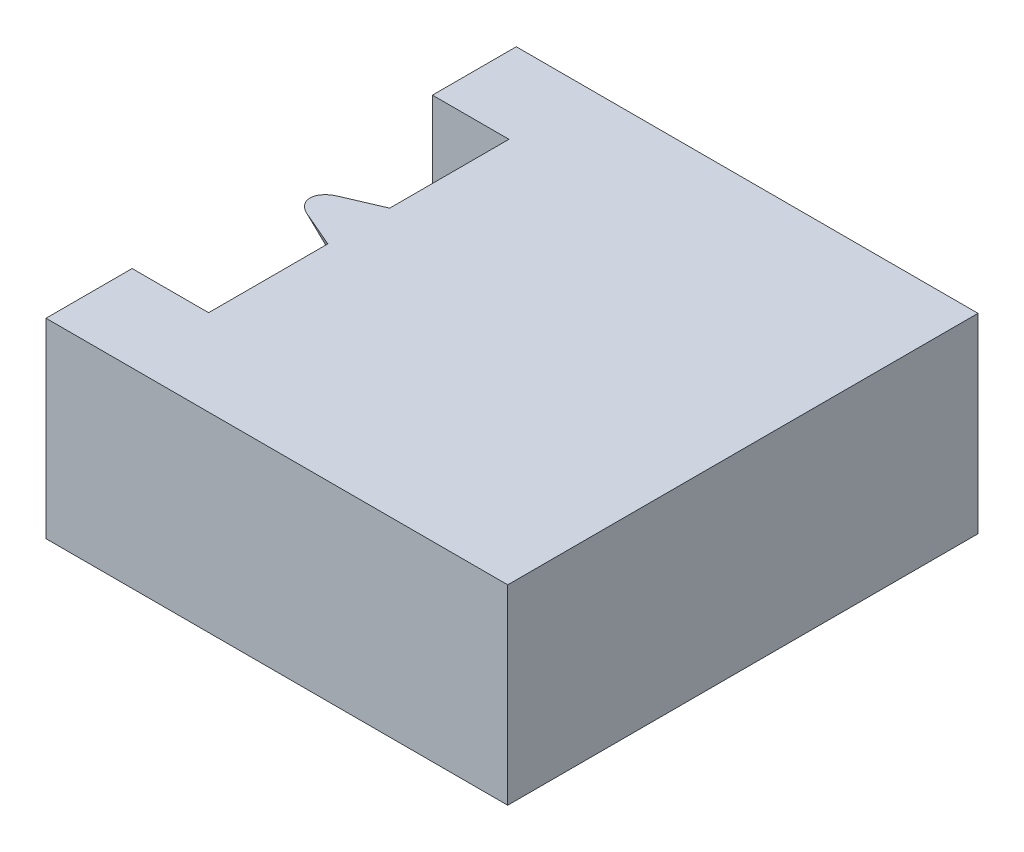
ISO-10303-21;
HEADER;
FILE_DESCRIPTION(('STEP AP214'),'2;1');
FILE_NAME('part.step','',(''),(''),'','','');
FILE_SCHEMA(('AUTOMOTIVE_DESIGN { 1 0 10303 214 1 1 1 1 }'));
ENDSEC;
DATA;
#1=APPLICATION_CONTEXT('core data for automotive mechanical design processes');
#2=APPLICATION_PROTOCOL_DEFINITION('international standard','automotive_design',2000,#1);
#3=PRODUCT_CONTEXT('',#1,'mechanical');
#4=PRODUCT('Part','Part','',(#3));
#5=PRODUCT_RELATED_PRODUCT_CATEGORY('part','',(#4));
#6=PRODUCT_DEFINITION_FORMATION('','',#4);
#7=PRODUCT_DEFINITION_CONTEXT('part definition',#1,'design');
#8=PRODUCT_DEFINITION('design','',#6,#7);
#9=PRODUCT_DEFINITION_SHAPE('','',#8);
#10=(LENGTH_UNIT() NAMED_UNIT(*) SI_UNIT(.MILLI.,.METRE.));
#11=(NAMED_UNIT(*) PLANE_ANGLE_UNIT() SI_UNIT($,.RADIAN.));
#12=(NAMED_UNIT(*) SI_UNIT($,.STERADIAN.) SOLID_ANGLE_UNIT());
#13=UNCERTAINTY_MEASURE_WITH_UNIT(LENGTH_MEASURE(1.E-05),#10,'distance_accuracy_value','');
#14=(GEOMETRIC_REPRESENTATION_CONTEXT(3) GLOBAL_UNCERTAINTY_ASSIGNED_CONTEXT((#13)) GLOBAL_UNIT_ASSIGNED_CONTEXT((#10,
#11,#12)) REPRESENTATION_CONTEXT('',''));
#15=CARTESIAN_POINT('',(0.,0.,0.));
#16=DIRECTION('',(0.,0.,1.));
#17=DIRECTION('',(1.,0.,0.));
#18=AXIS2_PLACEMENT_3D('',#15,#16,#17);
#19=CARTESIAN_POINT('',(-10.6910564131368,-12.5,15.4211919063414));
#20=DIRECTION('',(1.,0.,0.));
#21=DIRECTION('',(0.,0.,-1.));
#22=AXIS2_PLACEMENT_3D('',#19,#20,#21);
#23=PLANE('',#22);
#24=DIRECTION('',(0.,0.911273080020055,0.411802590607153));
#25=VECTOR('',#24,1.);
#26=CARTESIAN_POINT('',(-10.6910564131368,-7.77295609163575,4.96077237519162));
#27=LINE('',#26,#25);
#28=CARTESIAN_POINT('',(-10.6910564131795,-4.1540800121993,6.59613566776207));
#29=VERTEX_POINT('',#28);
#30=CARTESIAN_POINT('',(-10.6910564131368,-2.,7.56956037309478));
#31=VERTEX_POINT('',#30);
#32=EDGE_CURVE('E43',#29,#31,#27,.T.);
#33=ORIENTED_EDGE('',*,*,#32,.F.);
#34=CARTESIAN_POINT('',(-10.6910564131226,-3.28955769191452,5.59016738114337));
#35=DIRECTION('',(1.,0.,0.));
#36=DIRECTION('',(0.,-1.,0.));
#37=AXIS2_PLACEMENT_3D('',#34,#35,#36);
#38=ELLIPSE('',#37,1.63459717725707,1.18531846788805);
#39=CARTESIAN_POINT('',(-10.6910564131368,-4.15408001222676,4.58419909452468));
#40=VERTEX_POINT('',#39);
#41=EDGE_CURVE('E11',#40,#29,#38,.F.);
#42=ORIENTED_EDGE('',*,*,#41,.F.);
#43=DIRECTION('',(0.,-0.911273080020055,0.411802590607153));
#44=VECTOR('',#43,1.);
#45=CARTESIAN_POINT('',(-10.6910564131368,-15.1514273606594,9.55387967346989));
#46=LINE('',#45,#44);
#47=CARTESIAN_POINT('',(-10.6910564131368,-2.,3.61077438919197));
#48=VERTEX_POINT('',#47);
#49=EDGE_CURVE('E131',#48,#40,#46,.T.);
#50=ORIENTED_EDGE('',*,*,#49,.F.);
#51=DIRECTION('',(0.,0.,-1.));
#52=VECTOR('',#51,1.);
#53=CARTESIAN_POINT('',(-10.6910564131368,-2.,-4.24085714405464));
#54=LINE('',#53,#52);
#55=CARTESIAN_POINT('',(-10.6910564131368,-2.,-4.24085714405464));
#56=VERTEX_POINT('',#55);
#57=EDGE_CURVE('E211',#48,#56,#54,.T.);
#58=ORIENTED_EDGE('',*,*,#57,.T.);
#59=DIRECTION('',(0.,1.,0.));
#60=VECTOR('',#59,1.);
#61=CARTESIAN_POINT('',(-10.6910564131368,-12.5,-4.24085714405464));
#62=LINE('',#61,#60);
#63=CARTESIAN_POINT('',(-10.6910564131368,-12.5,-4.24085714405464));
#64=VERTEX_POINT('',#63);
#65=EDGE_CURVE('E202',#64,#56,#62,.T.);
#66=ORIENTED_EDGE('',*,*,#65,.F.);
#67=DIRECTION('',(0.,0.,-1.));
#68=VECTOR('',#67,1.);
#69=CARTESIAN_POINT('',(-10.6910564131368,-12.5,15.4211919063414));
#70=LINE('',#69,#68);
#71=CARTESIAN_POINT('',(-10.6910564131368,-12.5,15.4211919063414));
#72=VERTEX_POINT('',#71);
#73=EDGE_CURVE('E175',#72,#64,#70,.T.);
#74=ORIENTED_EDGE('',*,*,#73,.F.);
#75=DIRECTION('',(0.,1.,0.));
#76=VECTOR('',#75,1.);
#77=CARTESIAN_POINT('',(-10.6910564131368,-12.5,15.4211919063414));
#78=LINE('',#77,#76);
#79=CARTESIAN_POINT('',(-10.6910564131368,-2.,15.4211919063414));
#80=VERTEX_POINT('',#79);
#81=EDGE_CURVE('E205',#72,#80,#78,.T.);
#82=ORIENTED_EDGE('',*,*,#81,.T.);
#83=EDGE_CURVE('E212',#80,#31,#54,.T.);
#84=ORIENTED_EDGE('',*,*,#83,.T.);
#85=EDGE_LOOP('',(#33,#42,#50,#58,#66,#74,#82,#84));
#86=FACE_BOUND('',#85,.T.);
#87=ADVANCED_FACE('F28',(#86),#23,.F.);
#88=CARTESIAN_POINT('',(-12.6910564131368,-2.,15.4211919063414));
#89=DIRECTION('',(0.,0.,1.));
#90=DIRECTION('',(1.,0.,0.));
#91=AXIS2_PLACEMENT_3D('',#88,#89,#90);
#92=CYLINDRICAL_SURFACE('',#91,2.);
#93=CARTESIAN_POINT('',(-12.6910564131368,-2.,6.71131502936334));
#94=DIRECTION('',(0.364192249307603,0.383521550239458,-0.848690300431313));
#95=DIRECTION('',(0.58440573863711,0.615422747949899,0.528890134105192));
#96=AXIS2_PLACEMENT_3D('',#93,#94,#95);
#97=ELLIPSE('',#96,2.35657223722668,2.);
#98=CARTESIAN_POINT('',(-12.6910564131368,0.,7.61511126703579));
#99=VERTEX_POINT('',#98);
#100=EDGE_CURVE('E36',#31,#99,#97,.F.);
#101=ORIENTED_EDGE('',*,*,#100,.F.);
#102=ORIENTED_EDGE('',*,*,#83,.F.);
#103=CARTESIAN_POINT('',(-12.6910564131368,-2.,15.4211919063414));
#104=DIRECTION('',(0.,0.,1.));
#105=DIRECTION('',(1.,0.,0.));
#106=AXIS2_PLACEMENT_3D('',#103,#104,#105);
#107=CIRCLE('',#106,2.);
#108=CARTESIAN_POINT('',(-12.6910564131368,0.,15.4211919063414));
#109=VERTEX_POINT('',#108);
#110=EDGE_CURVE('E219',#109,#80,#107,.F.);
#111=ORIENTED_EDGE('',*,*,#110,.F.);
#112=DIRECTION('',(0.,0.,-1.));
#113=VECTOR('',#112,1.);
#114=CARTESIAN_POINT('',(-12.6910564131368,0.,15.4211919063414));
#115=LINE('',#114,#113);
#116=EDGE_CURVE('E217',#99,#109,#115,.F.);
#117=ORIENTED_EDGE('',*,*,#116,.F.);
#118=EDGE_LOOP('',(#101,#102,#111,#117));
#119=FACE_BOUND('',#118,.T.);
#120=ADVANCED_FACE('F228',(#119),#92,.F.);
#121=CARTESIAN_POINT('',(-12.6910564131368,-2.,4.46901973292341));
#122=DIRECTION('',(0.364192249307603,0.383521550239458,0.848690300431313));
#123=DIRECTION('',(-0.58440573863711,-0.615422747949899,0.528890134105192));
#124=AXIS2_PLACEMENT_3D('',#121,#122,#123);
#125=ELLIPSE('',#124,2.35657223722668,2.);
#126=CARTESIAN_POINT('',(-12.6910564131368,0.,3.56522349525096));
#127=VERTEX_POINT('',#126);
#128=EDGE_CURVE('E221',#127,#48,#125,.F.);
#129=ORIENTED_EDGE('',*,*,#128,.F.);
#130=CARTESIAN_POINT('',(-12.6910564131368,0.,-4.24085714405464));
#131=VERTEX_POINT('',#130);
#132=EDGE_CURVE('E126',#131,#127,#115,.F.);
#133=ORIENTED_EDGE('',*,*,#132,.F.);
#134=CARTESIAN_POINT('',(-12.6910564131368,-2.,-4.24085714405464));
#135=DIRECTION('',(0.,0.,-1.));
#136=DIRECTION('',(-1.,0.,0.));
#137=AXIS2_PLACEMENT_3D('',#134,#135,#136);
#138=CIRCLE('',#137,2.);
#139=EDGE_CURVE('E214',#56,#131,#138,.F.);
#140=ORIENTED_EDGE('',*,*,#139,.F.);
#141=ORIENTED_EDGE('',*,*,#57,.F.);
#142=EDGE_LOOP('',(#129,#133,#140,#141));
#143=FACE_BOUND('',#142,.T.);
#144=ADVANCED_FACE('F262',(#143),#92,.F.);
#145=CARTESIAN_POINT('',(-17.7000242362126,-12.5,21.0591071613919));
#146=DIRECTION('',(1.,0.,0.));
#147=DIRECTION('',(0.,0.,-1.));
#148=AXIS2_PLACEMENT_3D('',#145,#146,#147);
#149=PLANE('',#148);
#150=DIRECTION('',(0.,0.,-1.));
#151=VECTOR('',#150,1.);
#152=CARTESIAN_POINT('',(-17.7000242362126,0.,21.0591071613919));
#153=LINE('',#152,#151);
#154=CARTESIAN_POINT('',(-17.7000242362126,0.,21.0591071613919));
#155=VERTEX_POINT('',#154);
#156=CARTESIAN_POINT('',(-17.7000242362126,0.,15.4211919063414));
#157=VERTEX_POINT('',#156);
#158=EDGE_CURVE('E140',#155,#157,#153,.T.);
#159=ORIENTED_EDGE('',*,*,#158,.T.);
#160=DIRECTION('',(0.,1.,0.));
#161=VECTOR('',#160,1.);
#162=CARTESIAN_POINT('',(-17.7000242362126,-12.5,15.4211919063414));
#163=LINE('',#162,#161);
#164=CARTESIAN_POINT('',(-17.7000242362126,-12.5,15.4211919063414));
#165=VERTEX_POINT('',#164);
#166=EDGE_CURVE('E208',#165,#157,#163,.T.);
#167=ORIENTED_EDGE('',*,*,#166,.F.);
#168=DIRECTION('',(0.,0.,-1.));
#169=VECTOR('',#168,1.);
#170=CARTESIAN_POINT('',(-17.7000242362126,-12.5,21.0591071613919));
#171=LINE('',#170,#169);
#172=CARTESIAN_POINT('',(-17.7000242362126,-12.5,21.0591071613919));
#173=VERTEX_POINT('',#172);
#174=EDGE_CURVE('E170',#173,#165,#171,.T.);
#175=ORIENTED_EDGE('',*,*,#174,.F.);
#176=DIRECTION('',(0.,1.,0.));
#177=VECTOR('',#176,1.);
#178=CARTESIAN_POINT('',(-17.7000242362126,-12.5,21.0591071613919));
#179=LINE('',#178,#177);
#180=EDGE_CURVE('E187',#173,#155,#179,.T.);
#181=ORIENTED_EDGE('',*,*,#180,.T.);
#182=EDGE_LOOP('',(#159,#167,#175,#181));
#183=FACE_BOUND('',#182,.T.);
#184=ADVANCED_FACE('F30',(#183),#149,.F.);
#185=CARTESIAN_POINT('',(-17.7000242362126,-12.5,15.4211919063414));
#186=DIRECTION('',(0.,0.,1.));
#187=DIRECTION('',(1.,0.,0.));
#188=AXIS2_PLACEMENT_3D('',#185,#186,#187);
#189=PLANE('',#188);
#190=DIRECTION('',(1.,0.,0.));
#191=VECTOR('',#190,1.);
#192=CARTESIAN_POINT('',(-17.7000242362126,0.,15.4211919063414));
#193=LINE('',#192,#191);
#194=EDGE_CURVE('E152',#157,#109,#193,.T.);
#195=ORIENTED_EDGE('',*,*,#194,.T.);
#196=ORIENTED_EDGE('',*,*,#110,.T.);
#197=ORIENTED_EDGE('',*,*,#81,.F.);
#198=DIRECTION('',(1.,0.,0.));
#199=VECTOR('',#198,1.);
#200=CARTESIAN_POINT('',(-17.7000242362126,-12.5,15.4211919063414));
#201=LINE('',#200,#199);
#202=EDGE_CURVE('E173',#165,#72,#201,.T.);
#203=ORIENTED_EDGE('',*,*,#202,.F.);
#204=ORIENTED_EDGE('',*,*,#166,.T.);
#205=EDGE_LOOP('',(#195,#196,#197,#203,#204));
#206=FACE_BOUND('',#205,.T.);
#207=ADVANCED_FACE('F234',(#206),#189,.F.);
#208=CARTESIAN_POINT('',(-10.6910564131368,-12.5,-4.24085714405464));
#209=DIRECTION('',(0.,0.,-1.));
#210=DIRECTION('',(-1.,0.,0.));
#211=AXIS2_PLACEMENT_3D('',#208,#209,#210);
#212=PLANE('',#211);
#213=ORIENTED_EDGE('',*,*,#65,.T.);
#214=ORIENTED_EDGE('',*,*,#139,.T.);
#215=DIRECTION('',(-1.,0.,0.));
#216=VECTOR('',#215,1.);
#217=CARTESIAN_POINT('',(-10.6910564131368,0.,-4.24085714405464));
#218=LINE('',#217,#216);
#219=CARTESIAN_POINT('',(-17.7000242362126,0.,-4.24085714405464));
#220=VERTEX_POINT('',#219);
#221=EDGE_CURVE('E155',#131,#220,#218,.T.);
#222=ORIENTED_EDGE('',*,*,#221,.T.);
#223=DIRECTION('',(0.,1.,0.));
#224=VECTOR('',#223,1.);
#225=CARTESIAN_POINT('',(-17.7000242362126,-12.5,-4.24085714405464));
#226=LINE('',#225,#224);
#227=CARTESIAN_POINT('',(-17.7000242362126,-12.5,-4.24085714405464));
#228=VERTEX_POINT('',#227);
#229=EDGE_CURVE('E199',#228,#220,#226,.T.);
#230=ORIENTED_EDGE('',*,*,#229,.F.);
#231=DIRECTION('',(-1.,0.,0.));
#232=VECTOR('',#231,1.);
#233=CARTESIAN_POINT('',(-10.6910564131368,-12.5,-4.24085714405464));
#234=LINE('',#233,#232);
#235=EDGE_CURVE('E177',#64,#228,#234,.T.);
#236=ORIENTED_EDGE('',*,*,#235,.F.);
#237=EDGE_LOOP('',(#213,#214,#222,#230,#236));
#238=FACE_BOUND('',#237,.T.);
#239=ADVANCED_FACE('F258',(#238),#212,.F.);
#240=CARTESIAN_POINT('',(-17.7000242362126,-12.5,-4.24085714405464));
#241=DIRECTION('',(1.,0.,0.));
#242=DIRECTION('',(0.,0.,-1.));
#243=AXIS2_PLACEMENT_3D('',#240,#241,#242);
#244=PLANE('',#243);
#245=DIRECTION('',(0.,0.,-1.));
#246=VECTOR('',#245,1.);
#247=CARTESIAN_POINT('',(-17.7000242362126,0.,-4.24085714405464));
#248=LINE('',#247,#246);
#249=CARTESIAN_POINT('',(-17.7000242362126,0.,-9.72954384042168));
#250=VERTEX_POINT('',#249);
#251=EDGE_CURVE('E158',#220,#250,#248,.T.);
#252=ORIENTED_EDGE('',*,*,#251,.T.);
#253=DIRECTION('',(0.,1.,0.));
#254=VECTOR('',#253,1.);
#255=CARTESIAN_POINT('',(-17.7000242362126,-12.5,-9.72954384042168));
#256=LINE('',#255,#254);
#257=CARTESIAN_POINT('',(-17.7000242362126,-12.5,-9.72954384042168));
#258=VERTEX_POINT('',#257);
#259=EDGE_CURVE('E196',#258,#250,#256,.T.);
#260=ORIENTED_EDGE('',*,*,#259,.F.);
#261=DIRECTION('',(0.,0.,-1.));
#262=VECTOR('',#261,1.);
#263=CARTESIAN_POINT('',(-17.7000242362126,-12.5,-4.24085714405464));
#264=LINE('',#263,#262);
#265=EDGE_CURVE('E179',#228,#258,#264,.T.);
#266=ORIENTED_EDGE('',*,*,#265,.F.);
#267=ORIENTED_EDGE('',*,*,#229,.T.);
#268=EDGE_LOOP('',(#252,#260,#266,#267));
#269=FACE_BOUND('',#268,.T.);
#270=ADVANCED_FACE('F255',(#269),#244,.F.);
#271=CARTESIAN_POINT('',(-17.7000242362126,-12.5,-9.72954384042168));
#272=DIRECTION('',(0.,0.,1.));
#273=DIRECTION('',(1.,0.,0.));
#274=AXIS2_PLACEMENT_3D('',#271,#272,#273);
#275=PLANE('',#274);
#276=DIRECTION('',(1.,0.,0.));
#277=VECTOR('',#276,1.);
#278=CARTESIAN_POINT('',(-17.7000242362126,0.,-9.72954384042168));
#279=LINE('',#278,#277);
#280=CARTESIAN_POINT('',(12.5298116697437,0.,-9.72954384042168));
#281=VERTEX_POINT('',#280);
#282=EDGE_CURVE('E161',#250,#281,#279,.T.);
#283=ORIENTED_EDGE('',*,*,#282,.T.);
#284=DIRECTION('',(0.,1.,0.));
#285=VECTOR('',#284,1.);
#286=CARTESIAN_POINT('',(12.5298116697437,-12.5,-9.72954384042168));
#287=LINE('',#286,#285);
#288=CARTESIAN_POINT('',(12.5298116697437,-12.5,-9.72954384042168));
#289=VERTEX_POINT('',#288);
#290=EDGE_CURVE('E193',#289,#281,#287,.T.);
#291=ORIENTED_EDGE('',*,*,#290,.F.);
#292=DIRECTION('',(1.,0.,0.));
#293=VECTOR('',#292,1.);
#294=CARTESIAN_POINT('',(-17.7000242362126,-12.5,-9.72954384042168));
#295=LINE('',#294,#293);
#296=EDGE_CURVE('E181',#258,#289,#295,.T.);
#297=ORIENTED_EDGE('',*,*,#296,.F.);
#298=ORIENTED_EDGE('',*,*,#259,.T.);
#299=EDGE_LOOP('',(#283,#291,#297,#298));
#300=FACE_BOUND('',#299,.T.);
#301=ADVANCED_FACE('F251',(#300),#275,.F.);
#302=CARTESIAN_POINT('',(12.5298116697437,-12.5,21.0591071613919));
#303=DIRECTION('',(-1.,0.,0.));
#304=DIRECTION('',(0.,0.,1.));
#305=AXIS2_PLACEMENT_3D('',#302,#303,#304);
#306=PLANE('',#305);
#307=DIRECTION('',(0.,0.,1.));
#308=VECTOR('',#307,1.);
#309=CARTESIAN_POINT('',(12.5298116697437,0.,21.0591071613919));
#310=LINE('',#309,#308);
#311=CARTESIAN_POINT('',(12.5298116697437,0.,21.0591071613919));
#312=VERTEX_POINT('',#311);
#313=EDGE_CURVE('E164',#281,#312,#310,.T.);
#314=ORIENTED_EDGE('',*,*,#313,.T.);
#315=DIRECTION('',(0.,1.,0.));
#316=VECTOR('',#315,1.);
#317=CARTESIAN_POINT('',(12.5298116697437,-12.5,21.0591071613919));
#318=LINE('',#317,#316);
#319=CARTESIAN_POINT('',(12.5298116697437,-12.5,21.0591071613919));
#320=VERTEX_POINT('',#319);
#321=EDGE_CURVE('E190',#320,#312,#318,.T.);
#322=ORIENTED_EDGE('',*,*,#321,.F.);
#323=DIRECTION('',(0.,0.,1.));
#324=VECTOR('',#323,1.);
#325=CARTESIAN_POINT('',(12.5298116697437,-12.5,21.0591071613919));
#326=LINE('',#325,#324);
#327=EDGE_CURVE('E183',#289,#320,#326,.T.);
#328=ORIENTED_EDGE('',*,*,#327,.F.);
#329=ORIENTED_EDGE('',*,*,#290,.T.);
#330=EDGE_LOOP('',(#314,#322,#328,#329));
#331=FACE_BOUND('',#330,.T.);
#332=ADVANCED_FACE('F249',(#331),#306,.F.);
#333=CARTESIAN_POINT('',(-17.7000242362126,-12.5,21.0591071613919));
#334=DIRECTION('',(0.,0.,-1.));
#335=DIRECTION('',(-1.,0.,0.));
#336=AXIS2_PLACEMENT_3D('',#333,#334,#335);
#337=PLANE('',#336);
#338=DIRECTION('',(-1.,0.,0.));
#339=VECTOR('',#338,1.);
#340=CARTESIAN_POINT('',(-17.7000242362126,0.,21.0591071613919));
#341=LINE('',#340,#339);
#342=EDGE_CURVE('E167',#312,#155,#341,.T.);
#343=ORIENTED_EDGE('',*,*,#342,.T.);
#344=ORIENTED_EDGE('',*,*,#180,.F.);
#345=DIRECTION('',(-1.,0.,0.));
#346=VECTOR('',#345,1.);
#347=CARTESIAN_POINT('',(-17.7000242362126,-12.5,21.0591071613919));
#348=LINE('',#347,#346);
#349=EDGE_CURVE('E185',#320,#173,#348,.T.);
#350=ORIENTED_EDGE('',*,*,#349,.F.);
#351=ORIENTED_EDGE('',*,*,#321,.T.);
#352=EDGE_LOOP('',(#343,#344,#350,#351));
#353=FACE_BOUND('',#352,.T.);
#354=ADVANCED_FACE('F239',(#353),#337,.F.);
#355=CARTESIAN_POINT('',(-17.7000242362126,-12.5,15.4211919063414));
#356=DIRECTION('',(0.,-1.,0.));
#357=DIRECTION('',(0.,0.,-1.));
#358=AXIS2_PLACEMENT_3D('',#355,#356,#357);
#359=PLANE('',#358);
#360=ORIENTED_EDGE('',*,*,#174,.T.);
#361=ORIENTED_EDGE('',*,*,#202,.T.);
#362=ORIENTED_EDGE('',*,*,#73,.T.);
#363=ORIENTED_EDGE('',*,*,#235,.T.);
#364=ORIENTED_EDGE('',*,*,#265,.T.);
#365=ORIENTED_EDGE('',*,*,#296,.T.);
#366=ORIENTED_EDGE('',*,*,#327,.T.);
#367=ORIENTED_EDGE('',*,*,#349,.T.);
#368=EDGE_LOOP('',(#360,#361,#362,#363,#364,#365,#366,#367));
#369=FACE_BOUND('',#368,.T.);
#370=ADVANCED_FACE('F244',(#369),#359,.T.);
#371=CARTESIAN_POINT('',(-499999.568316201,474786.389729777,5.59016738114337));
#372=DIRECTION('',(0.725144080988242,-0.688597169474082,0.));
#373=DIRECTION('',(0.688597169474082,0.725144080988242,0.));
#374=AXIS2_PLACEMENT_3D('',#371,#372,#373);
#375=CYLINDRICAL_SURFACE('',#374,1.18531846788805);
#376=DIRECTION('',(0.725144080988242,-0.688597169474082,0.));
#377=VECTOR('',#376,1.);
#378=CARTESIAN_POINT('',(-500000.,474785.935134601,6.59613566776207));
#379=LINE('',#378,#377);
#380=CARTESIAN_POINT('',(-15.0656119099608,0.,6.59613566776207));
#381=VERTEX_POINT('',#380);
#382=EDGE_CURVE('E139',#381,#29,#379,.T.);
#383=ORIENTED_EDGE('',*,*,#382,.F.);
#384=CARTESIAN_POINT('',(-14.1552055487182,0.,5.59016738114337));
#385=DIRECTION('',(0.,1.,0.));
#386=DIRECTION('',(1.,0.,0.));
#387=AXIS2_PLACEMENT_3D('',#384,#385,#386);
#388=ELLIPSE('',#387,1.72135251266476,1.18531846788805);
#389=CARTESIAN_POINT('',(-15.0656119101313,0.,4.5841990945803));
#390=VERTEX_POINT('',#389);
#391=EDGE_CURVE('E123',#381,#390,#388,.F.);
#392=ORIENTED_EDGE('',*,*,#391,.T.);
#393=DIRECTION('',(0.725144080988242,-0.688597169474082,0.));
#394=VECTOR('',#393,1.);
#395=CARTESIAN_POINT('',(-500000.,474785.935134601,4.58419909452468));
#396=LINE('',#395,#394);
#397=EDGE_CURVE('E137',#390,#40,#396,.T.);
#398=ORIENTED_EDGE('',*,*,#397,.T.);
#399=ORIENTED_EDGE('',*,*,#41,.T.);
#400=EDGE_LOOP('',(#383,#392,#398,#399));
#401=FACE_BOUND('',#400,.T.);
#402=ADVANCED_FACE('F136',(#401),#375,.T.);
#403=CARTESIAN_POINT('',(-500000.,474785.935134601,6.59613566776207));
#404=DIRECTION('',(0.364192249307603,0.383521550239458,-0.848690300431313));
#405=DIRECTION('',(0.,0.911273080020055,0.411802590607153));
#406=AXIS2_PLACEMENT_3D('',#403,#404,#405);
#407=PLANE('',#406);
#408=ORIENTED_EDGE('',*,*,#100,.T.);
#409=DIRECTION('',(-0.918961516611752,0.,-0.394347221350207));
#410=VECTOR('',#409,1.);
#411=CARTESIAN_POINT('',(-30.3760743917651,0.,0.0260691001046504));
#412=LINE('',#411,#410);
#413=EDGE_CURVE('E141',#99,#381,#412,.T.);
#414=ORIENTED_EDGE('',*,*,#413,.T.);
#415=ORIENTED_EDGE('',*,*,#382,.T.);
#416=ORIENTED_EDGE('',*,*,#32,.T.);
#417=EDGE_LOOP('',(#408,#414,#415,#416));
#418=FACE_BOUND('',#417,.T.);
#419=ADVANCED_FACE('F224',(#418),#407,.F.);
#420=CARTESIAN_POINT('',(-500000.,474785.935134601,4.58419909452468));
#421=DIRECTION('',(0.364192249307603,0.383521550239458,0.848690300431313));
#422=DIRECTION('',(0.,-0.911273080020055,0.411802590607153));
#423=AXIS2_PLACEMENT_3D('',#420,#421,#422);
#424=PLANE('',#423);
#425=ORIENTED_EDGE('',*,*,#397,.F.);
#426=DIRECTION('',(0.918961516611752,0.,-0.394347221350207));
#427=VECTOR('',#426,1.);
#428=CARTESIAN_POINT('',(-50.5045612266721,0.,19.791855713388));
#429=LINE('',#428,#427);
#430=EDGE_CURVE('E120',#390,#127,#429,.T.);
#431=ORIENTED_EDGE('',*,*,#430,.T.);
#432=ORIENTED_EDGE('',*,*,#128,.T.);
#433=ORIENTED_EDGE('',*,*,#49,.T.);
#434=EDGE_LOOP('',(#425,#431,#432,#433));
#435=FACE_BOUND('',#434,.T.);
#436=ADVANCED_FACE('F143',(#435),#424,.F.);
#437=CARTESIAN_POINT('',(41.1067880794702,0.,120.056001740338));
#438=DIRECTION('',(0.,-1.,0.));
#439=DIRECTION('',(0.,0.,-1.));
#440=AXIS2_PLACEMENT_3D('',#437,#438,#439);
#441=PLANE('',#440);
#442=ORIENTED_EDGE('',*,*,#251,.F.);
#443=ORIENTED_EDGE('',*,*,#221,.F.);
#444=ORIENTED_EDGE('',*,*,#132,.T.);
#445=ORIENTED_EDGE('',*,*,#430,.F.);
#446=ORIENTED_EDGE('',*,*,#391,.F.);
#447=ORIENTED_EDGE('',*,*,#413,.F.);
#448=ORIENTED_EDGE('',*,*,#116,.T.);
#449=ORIENTED_EDGE('',*,*,#194,.F.);
#450=ORIENTED_EDGE('',*,*,#158,.F.);
#451=ORIENTED_EDGE('',*,*,#342,.F.);
#452=ORIENTED_EDGE('',*,*,#313,.F.);
#453=ORIENTED_EDGE('',*,*,#282,.F.);
#454=EDGE_LOOP('',(#442,#443,#444,#445,#446,#447,#448,#449,#450,#451,#452,#453));
#455=FACE_BOUND('',#454,.T.);
#456=ADVANCED_FACE('F122',(#455),#441,.F.);
#457=CLOSED_SHELL('',(#87,#120,#144,#184,#207,#239,#270,#301,#332,#354,#370,#402,#419,#436,#456));
#458=MANIFOLD_SOLID_BREP('B2',#457);
#459=ADVANCED_BREP_SHAPE_REPRESENTATION('',(#18,#458),#14);
#460=SHAPE_DEFINITION_REPRESENTATION(#9,#459);
ENDSEC;
END-ISO-10303-21;
